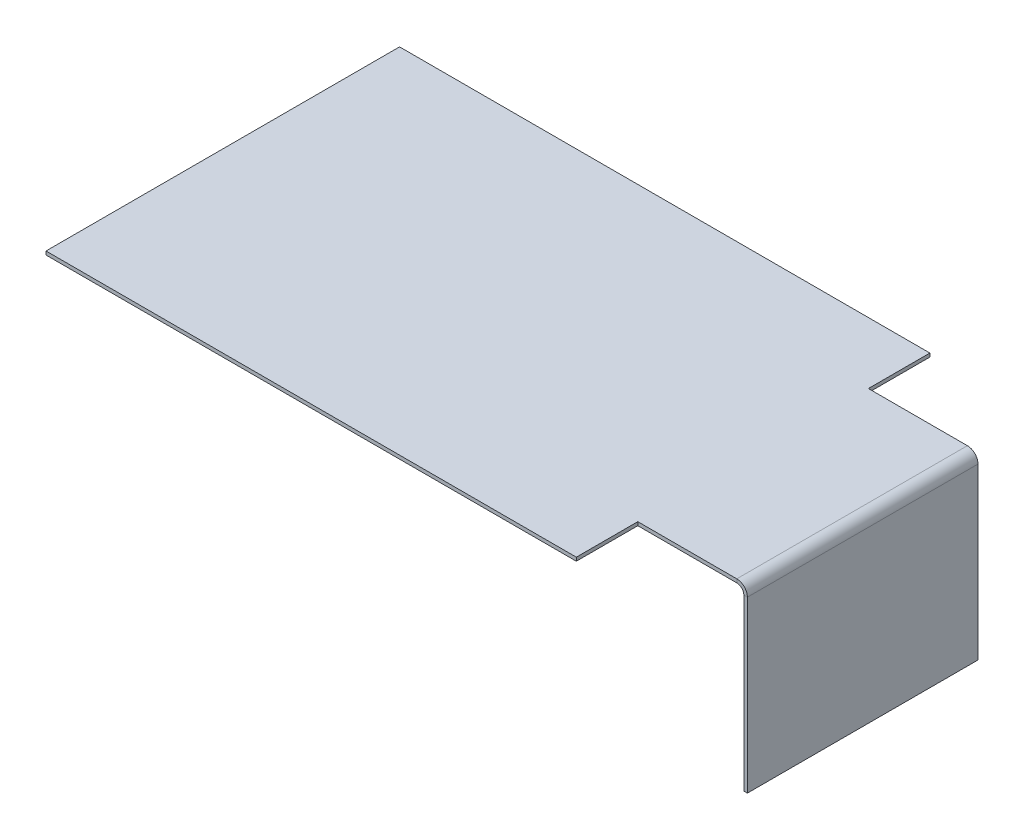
ISO-10303-21;
HEADER;
FILE_DESCRIPTION(('STEP AP214'),'2;1');
FILE_NAME('part.step','',(''),(''),'','','');
FILE_SCHEMA(('AUTOMOTIVE_DESIGN { 1 0 10303 214 1 1 1 1 }'));
ENDSEC;
DATA;
#1=APPLICATION_CONTEXT('core data for automotive mechanical design processes');
#2=APPLICATION_PROTOCOL_DEFINITION('international standard','automotive_design',2000,#1);
#3=PRODUCT_CONTEXT('',#1,'mechanical');
#4=PRODUCT('Part','Part','',(#3));
#5=PRODUCT_RELATED_PRODUCT_CATEGORY('part','',(#4));
#6=PRODUCT_DEFINITION_FORMATION('','',#4);
#7=PRODUCT_DEFINITION_CONTEXT('part definition',#1,'design');
#8=PRODUCT_DEFINITION('design','',#6,#7);
#9=PRODUCT_DEFINITION_SHAPE('','',#8);
#10=(LENGTH_UNIT() NAMED_UNIT(*) SI_UNIT(.MILLI.,.METRE.));
#11=(NAMED_UNIT(*) PLANE_ANGLE_UNIT() SI_UNIT($,.RADIAN.));
#12=(NAMED_UNIT(*) SI_UNIT($,.STERADIAN.) SOLID_ANGLE_UNIT());
#13=UNCERTAINTY_MEASURE_WITH_UNIT(LENGTH_MEASURE(1.E-05),#10,'distance_accuracy_value','');
#14=(GEOMETRIC_REPRESENTATION_CONTEXT(3) GLOBAL_UNCERTAINTY_ASSIGNED_CONTEXT((#13)) GLOBAL_UNIT_ASSIGNED_CONTEXT((#10,
#11,#12)) REPRESENTATION_CONTEXT('',''));
#15=CARTESIAN_POINT('',(0.,0.,0.));
#16=DIRECTION('',(0.,0.,1.));
#17=DIRECTION('',(1.,0.,0.));
#18=AXIS2_PLACEMENT_3D('',#15,#16,#17);
#19=CARTESIAN_POINT('',(103.,-2.,-32.6144));
#20=DIRECTION('',(0.,0.,-1.));
#21=DIRECTION('',(-1.,0.,0.));
#22=AXIS2_PLACEMENT_3D('',#19,#20,#21);
#23=PLANE('',#22);
#24=DIRECTION('',(1.,0.,0.));
#25=VECTOR('',#24,1.);
#26=CARTESIAN_POINT('',(106.,-1.99999999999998,-32.6144));
#27=LINE('',#26,#25);
#28=CARTESIAN_POINT('',(105.,-1.99999999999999,-32.6144));
#29=VERTEX_POINT('',#28);
#30=CARTESIAN_POINT('',(106.,-1.99999999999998,-32.6144));
#31=VERTEX_POINT('',#30);
#32=EDGE_CURVE('E161',#29,#31,#27,.T.);
#33=ORIENTED_EDGE('',*,*,#32,.F.);
#34=CARTESIAN_POINT('',(103.,-2.,-32.6144));
#35=DIRECTION('',(0.,0.,1.));
#36=DIRECTION('',(1.,0.,0.));
#37=AXIS2_PLACEMENT_3D('',#34,#35,#36);
#38=CIRCLE('',#37,2.);
#39=CARTESIAN_POINT('',(103.,0.,-32.6144));
#40=VERTEX_POINT('',#39);
#41=EDGE_CURVE('E124',#40,#29,#38,.F.);
#42=ORIENTED_EDGE('',*,*,#41,.F.);
#43=DIRECTION('',(0.,1.,0.));
#44=VECTOR('',#43,1.);
#45=CARTESIAN_POINT('',(103.,0.,-32.6144));
#46=LINE('',#45,#44);
#47=CARTESIAN_POINT('',(103.,1.00000000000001,-32.6144));
#48=VERTEX_POINT('',#47);
#49=EDGE_CURVE('E11',#40,#48,#46,.T.);
#50=ORIENTED_EDGE('',*,*,#49,.T.);
#51=CARTESIAN_POINT('',(103.,-2.,-32.6144));
#52=DIRECTION('',(0.,0.,1.));
#53=DIRECTION('',(1.,0.,0.));
#54=AXIS2_PLACEMENT_3D('',#51,#52,#53);
#55=CIRCLE('',#54,3.);
#56=EDGE_CURVE('E189',#48,#31,#55,.F.);
#57=ORIENTED_EDGE('',*,*,#56,.T.);
#58=EDGE_LOOP('',(#33,#42,#50,#57));
#59=FACE_BOUND('',#58,.T.);
#60=ADVANCED_FACE('F34',(#59),#23,.T.);
#61=CARTESIAN_POINT('',(103.,-2.,32.6144));
#62=DIRECTION('',(0.,0.,-1.));
#63=DIRECTION('',(-1.,0.,0.));
#64=AXIS2_PLACEMENT_3D('',#61,#62,#63);
#65=PLANE('',#64);
#66=CARTESIAN_POINT('',(103.,-2.,32.6144));
#67=DIRECTION('',(0.,0.,1.));
#68=DIRECTION('',(1.,0.,0.));
#69=AXIS2_PLACEMENT_3D('',#66,#67,#68);
#70=CIRCLE('',#69,2.);
#71=CARTESIAN_POINT('',(105.,-1.99999999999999,32.6144));
#72=VERTEX_POINT('',#71);
#73=CARTESIAN_POINT('',(103.,0.,32.6144));
#74=VERTEX_POINT('',#73);
#75=EDGE_CURVE('E130',#72,#74,#70,.T.);
#76=ORIENTED_EDGE('',*,*,#75,.F.);
#77=DIRECTION('',(1.,0.,0.));
#78=VECTOR('',#77,1.);
#79=CARTESIAN_POINT('',(105.,-1.99999999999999,32.6144));
#80=LINE('',#79,#78);
#81=CARTESIAN_POINT('',(106.,-1.99999999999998,32.6144));
#82=VERTEX_POINT('',#81);
#83=EDGE_CURVE('E128',#72,#82,#80,.T.);
#84=ORIENTED_EDGE('',*,*,#83,.T.);
#85=CARTESIAN_POINT('',(103.,-2.,32.6144));
#86=DIRECTION('',(0.,0.,1.));
#87=DIRECTION('',(1.,0.,0.));
#88=AXIS2_PLACEMENT_3D('',#85,#86,#87);
#89=CIRCLE('',#88,3.);
#90=CARTESIAN_POINT('',(103.,1.00000000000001,32.6144));
#91=VERTEX_POINT('',#90);
#92=EDGE_CURVE('E119',#82,#91,#89,.T.);
#93=ORIENTED_EDGE('',*,*,#92,.T.);
#94=DIRECTION('',(0.,1.,0.));
#95=VECTOR('',#94,1.);
#96=CARTESIAN_POINT('',(103.,0.,32.6144));
#97=LINE('',#96,#95);
#98=EDGE_CURVE('E38',#74,#91,#97,.T.);
#99=ORIENTED_EDGE('',*,*,#98,.F.);
#100=EDGE_LOOP('',(#76,#84,#93,#99));
#101=FACE_BOUND('',#100,.T.);
#102=ADVANCED_FACE('F36',(#101),#65,.F.);
#103=CARTESIAN_POINT('',(103.,-2.,32.6144));
#104=DIRECTION('',(0.,0.,1.));
#105=DIRECTION('',(1.,0.,0.));
#106=AXIS2_PLACEMENT_3D('',#103,#104,#105);
#107=CYLINDRICAL_SURFACE('',#106,3.);
#108=DIRECTION('',(0.,0.,1.));
#109=VECTOR('',#108,1.);
#110=CARTESIAN_POINT('',(103.,1.00000000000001,32.6144));
#111=LINE('',#110,#109);
#112=EDGE_CURVE('E49',#91,#48,#111,.F.);
#113=ORIENTED_EDGE('',*,*,#112,.F.);
#114=ORIENTED_EDGE('',*,*,#92,.F.);
#115=DIRECTION('',(0.,0.,1.));
#116=VECTOR('',#115,1.);
#117=CARTESIAN_POINT('',(106.,-1.99999999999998,32.6144));
#118=LINE('',#117,#116);
#119=EDGE_CURVE('E54',#31,#82,#118,.T.);
#120=ORIENTED_EDGE('',*,*,#119,.F.);
#121=ORIENTED_EDGE('',*,*,#56,.F.);
#122=EDGE_LOOP('',(#113,#114,#120,#121));
#123=FACE_BOUND('',#122,.T.);
#124=ADVANCED_FACE('F121',(#123),#107,.T.);
#125=CARTESIAN_POINT('',(103.,-2.,32.6144));
#126=DIRECTION('',(0.,0.,1.));
#127=DIRECTION('',(1.,0.,0.));
#128=AXIS2_PLACEMENT_3D('',#125,#126,#127);
#129=CYLINDRICAL_SURFACE('',#128,2.);
#130=DIRECTION('',(0.,0.,1.));
#131=VECTOR('',#130,1.);
#132=CARTESIAN_POINT('',(103.,0.,32.6144));
#133=LINE('',#132,#131);
#134=EDGE_CURVE('E184',#74,#40,#133,.F.);
#135=ORIENTED_EDGE('',*,*,#134,.T.);
#136=ORIENTED_EDGE('',*,*,#41,.T.);
#137=DIRECTION('',(0.,0.,-1.));
#138=VECTOR('',#137,1.);
#139=CARTESIAN_POINT('',(105.,-1.99999999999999,-32.6144));
#140=LINE('',#139,#138);
#141=EDGE_CURVE('E135',#29,#72,#140,.F.);
#142=ORIENTED_EDGE('',*,*,#141,.T.);
#143=ORIENTED_EDGE('',*,*,#75,.T.);
#144=EDGE_LOOP('',(#135,#136,#142,#143));
#145=FACE_BOUND('',#144,.T.);
#146=ADVANCED_FACE('F200',(#145),#129,.F.);
#147=CARTESIAN_POINT('',(75.,1.,-50.));
#148=DIRECTION('',(-1.,0.,0.));
#149=DIRECTION('',(0.,0.,1.));
#150=AXIS2_PLACEMENT_3D('',#147,#148,#149);
#151=PLANE('',#150);
#152=DIRECTION('',(0.,1.,0.));
#153=VECTOR('',#152,1.);
#154=CARTESIAN_POINT('',(75.,0.,-32.6144));
#155=LINE('',#154,#153);
#156=CARTESIAN_POINT('',(75.,0.,-32.6144));
#157=VERTEX_POINT('',#156);
#158=CARTESIAN_POINT('',(75.,1.00000000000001,-32.6144));
#159=VERTEX_POINT('',#158);
#160=EDGE_CURVE('E169',#157,#159,#155,.T.);
#161=ORIENTED_EDGE('',*,*,#160,.F.);
#162=DIRECTION('',(0.,0.,-1.));
#163=VECTOR('',#162,1.);
#164=CARTESIAN_POINT('',(75.,0.,-50.));
#165=LINE('',#164,#163);
#166=CARTESIAN_POINT('',(75.,0.,-50.));
#167=VERTEX_POINT('',#166);
#168=EDGE_CURVE('E413',#157,#167,#165,.T.);
#169=ORIENTED_EDGE('',*,*,#168,.T.);
#170=DIRECTION('',(0.,-1.,0.));
#171=VECTOR('',#170,1.);
#172=CARTESIAN_POINT('',(75.,1.,-50.));
#173=LINE('',#172,#171);
#174=CARTESIAN_POINT('',(75.,1.,-50.));
#175=VERTEX_POINT('',#174);
#176=EDGE_CURVE('E463',#175,#167,#173,.T.);
#177=ORIENTED_EDGE('',*,*,#176,.F.);
#178=DIRECTION('',(0.,0.,-1.));
#179=VECTOR('',#178,1.);
#180=CARTESIAN_POINT('',(75.,1.,-50.));
#181=LINE('',#180,#179);
#182=EDGE_CURVE('E415',#159,#175,#181,.T.);
#183=ORIENTED_EDGE('',*,*,#182,.F.);
#184=EDGE_LOOP('',(#161,#169,#177,#183));
#185=FACE_BOUND('',#184,.T.);
#186=ADVANCED_FACE('F233',(#185),#151,.F.);
#187=CARTESIAN_POINT('',(-75.,1.,-50.));
#188=DIRECTION('',(1.,0.,0.));
#189=DIRECTION('',(0.,0.,-1.));
#190=AXIS2_PLACEMENT_3D('',#187,#188,#189);
#191=PLANE('',#190);
#192=DIRECTION('',(0.,0.,1.));
#193=VECTOR('',#192,1.);
#194=CARTESIAN_POINT('',(-75.,0.,-50.));
#195=LINE('',#194,#193);
#196=CARTESIAN_POINT('',(-75.,0.,-50.));
#197=VERTEX_POINT('',#196);
#198=CARTESIAN_POINT('',(-75.,0.,50.));
#199=VERTEX_POINT('',#198);
#200=EDGE_CURVE('E427',#197,#199,#195,.T.);
#201=ORIENTED_EDGE('',*,*,#200,.T.);
#202=DIRECTION('',(0.,-1.,0.));
#203=VECTOR('',#202,1.);
#204=CARTESIAN_POINT('',(-75.,1.,50.));
#205=LINE('',#204,#203);
#206=CARTESIAN_POINT('',(-75.,1.,50.));
#207=VERTEX_POINT('',#206);
#208=EDGE_CURVE('E187',#207,#199,#205,.T.);
#209=ORIENTED_EDGE('',*,*,#208,.F.);
#210=DIRECTION('',(0.,0.,1.));
#211=VECTOR('',#210,1.);
#212=CARTESIAN_POINT('',(-75.,1.,-50.));
#213=LINE('',#212,#211);
#214=CARTESIAN_POINT('',(-75.,1.,-50.));
#215=VERTEX_POINT('',#214);
#216=EDGE_CURVE('E439',#215,#207,#213,.T.);
#217=ORIENTED_EDGE('',*,*,#216,.F.);
#218=DIRECTION('',(0.,-1.,0.));
#219=VECTOR('',#218,1.);
#220=CARTESIAN_POINT('',(-75.,1.,-50.));
#221=LINE('',#220,#219);
#222=EDGE_CURVE('E459',#215,#197,#221,.T.);
#223=ORIENTED_EDGE('',*,*,#222,.T.);
#224=EDGE_LOOP('',(#201,#209,#217,#223));
#225=FACE_BOUND('',#224,.T.);
#226=ADVANCED_FACE('F236',(#225),#191,.F.);
#227=CARTESIAN_POINT('',(-75.,1.,50.));
#228=DIRECTION('',(0.,0.,-1.));
#229=DIRECTION('',(-1.,0.,0.));
#230=AXIS2_PLACEMENT_3D('',#227,#228,#229);
#231=PLANE('',#230);
#232=DIRECTION('',(1.,0.,0.));
#233=VECTOR('',#232,1.);
#234=CARTESIAN_POINT('',(-75.,0.,50.));
#235=LINE('',#234,#233);
#236=CARTESIAN_POINT('',(75.,0.,50.));
#237=VERTEX_POINT('',#236);
#238=EDGE_CURVE('E423',#199,#237,#235,.T.);
#239=ORIENTED_EDGE('',*,*,#238,.T.);
#240=DIRECTION('',(0.,-1.,0.));
#241=VECTOR('',#240,1.);
#242=CARTESIAN_POINT('',(75.,1.,50.));
#243=LINE('',#242,#241);
#244=CARTESIAN_POINT('',(75.,1.,50.));
#245=VERTEX_POINT('',#244);
#246=EDGE_CURVE('E466',#245,#237,#243,.T.);
#247=ORIENTED_EDGE('',*,*,#246,.F.);
#248=DIRECTION('',(1.,0.,0.));
#249=VECTOR('',#248,1.);
#250=CARTESIAN_POINT('',(-75.,1.,50.));
#251=LINE('',#250,#249);
#252=EDGE_CURVE('E442',#207,#245,#251,.T.);
#253=ORIENTED_EDGE('',*,*,#252,.F.);
#254=ORIENTED_EDGE('',*,*,#208,.T.);
#255=EDGE_LOOP('',(#239,#247,#253,#254));
#256=FACE_BOUND('',#255,.T.);
#257=ADVANCED_FACE('F239',(#256),#231,.F.);
#258=CARTESIAN_POINT('',(75.,0.,32.6144));
#259=VERTEX_POINT('',#258);
#260=EDGE_CURVE('E422',#237,#259,#165,.T.);
#261=ORIENTED_EDGE('',*,*,#260,.T.);
#262=DIRECTION('',(0.,1.,0.));
#263=VECTOR('',#262,1.);
#264=CARTESIAN_POINT('',(75.,0.,32.6144));
#265=LINE('',#264,#263);
#266=CARTESIAN_POINT('',(75.,1.,32.6144));
#267=VERTEX_POINT('',#266);
#268=EDGE_CURVE('E173',#259,#267,#265,.T.);
#269=ORIENTED_EDGE('',*,*,#268,.T.);
#270=EDGE_CURVE('E432',#245,#267,#181,.T.);
#271=ORIENTED_EDGE('',*,*,#270,.F.);
#272=ORIENTED_EDGE('',*,*,#246,.T.);
#273=EDGE_LOOP('',(#261,#269,#271,#272));
#274=FACE_BOUND('',#273,.T.);
#275=ADVANCED_FACE('F243',(#274),#151,.F.);
#276=CARTESIAN_POINT('',(-75.,1.,-50.));
#277=DIRECTION('',(0.,0.,1.));
#278=DIRECTION('',(1.,0.,0.));
#279=AXIS2_PLACEMENT_3D('',#276,#277,#278);
#280=PLANE('',#279);
#281=DIRECTION('',(-1.,0.,0.));
#282=VECTOR('',#281,1.);
#283=CARTESIAN_POINT('',(-75.,0.,-50.));
#284=LINE('',#283,#282);
#285=EDGE_CURVE('E421',#167,#197,#284,.T.);
#286=ORIENTED_EDGE('',*,*,#285,.T.);
#287=ORIENTED_EDGE('',*,*,#222,.F.);
#288=DIRECTION('',(-1.,0.,0.));
#289=VECTOR('',#288,1.);
#290=CARTESIAN_POINT('',(-75.,1.,-50.));
#291=LINE('',#290,#289);
#292=EDGE_CURVE('E445',#175,#215,#291,.T.);
#293=ORIENTED_EDGE('',*,*,#292,.F.);
#294=ORIENTED_EDGE('',*,*,#176,.T.);
#295=EDGE_LOOP('',(#286,#287,#293,#294));
#296=FACE_BOUND('',#295,.T.);
#297=ADVANCED_FACE('F247',(#296),#280,.F.);
#298=CARTESIAN_POINT('',(-75.,1.,50.));
#299=DIRECTION('',(0.,1.,0.));
#300=DIRECTION('',(0.,0.,1.));
#301=AXIS2_PLACEMENT_3D('',#298,#299,#300);
#302=PLANE('',#301);
#303=ORIENTED_EDGE('',*,*,#216,.T.);
#304=ORIENTED_EDGE('',*,*,#252,.T.);
#305=ORIENTED_EDGE('',*,*,#270,.T.);
#306=DIRECTION('',(-1.,0.,0.));
#307=VECTOR('',#306,1.);
#308=CARTESIAN_POINT('',(103.,1.00000000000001,32.6144));
#309=LINE('',#308,#307);
#310=EDGE_CURVE('E178',#91,#267,#309,.T.);
#311=ORIENTED_EDGE('',*,*,#310,.F.);
#312=ORIENTED_EDGE('',*,*,#112,.T.);
#313=DIRECTION('',(-1.,0.,0.));
#314=VECTOR('',#313,1.);
#315=CARTESIAN_POINT('',(103.,1.00000000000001,-32.6144));
#316=LINE('',#315,#314);
#317=EDGE_CURVE('E176',#48,#159,#316,.T.);
#318=ORIENTED_EDGE('',*,*,#317,.T.);
#319=ORIENTED_EDGE('',*,*,#182,.T.);
#320=ORIENTED_EDGE('',*,*,#292,.T.);
#321=EDGE_LOOP('',(#303,#304,#305,#311,#312,#318,#319,#320));
#322=FACE_BOUND('',#321,.T.);
#323=ADVANCED_FACE('F251',(#322),#302,.T.);
#324=CARTESIAN_POINT('',(-75.,0.,50.));
#325=DIRECTION('',(0.,1.,0.));
#326=DIRECTION('',(0.,0.,1.));
#327=AXIS2_PLACEMENT_3D('',#324,#325,#326);
#328=PLANE('',#327);
#329=ORIENTED_EDGE('',*,*,#200,.F.);
#330=ORIENTED_EDGE('',*,*,#285,.F.);
#331=ORIENTED_EDGE('',*,*,#168,.F.);
#332=DIRECTION('',(-1.,0.,0.));
#333=VECTOR('',#332,1.);
#334=CARTESIAN_POINT('',(103.,0.,-32.6144));
#335=LINE('',#334,#333);
#336=EDGE_CURVE('E179',#40,#157,#335,.T.);
#337=ORIENTED_EDGE('',*,*,#336,.F.);
#338=ORIENTED_EDGE('',*,*,#134,.F.);
#339=DIRECTION('',(-1.,0.,0.));
#340=VECTOR('',#339,1.);
#341=CARTESIAN_POINT('',(103.,0.,32.6144));
#342=LINE('',#341,#340);
#343=EDGE_CURVE('E197',#74,#259,#342,.T.);
#344=ORIENTED_EDGE('',*,*,#343,.T.);
#345=ORIENTED_EDGE('',*,*,#260,.F.);
#346=ORIENTED_EDGE('',*,*,#238,.F.);
#347=EDGE_LOOP('',(#329,#330,#331,#337,#338,#344,#345,#346));
#348=FACE_BOUND('',#347,.T.);
#349=ADVANCED_FACE('F255',(#348),#328,.F.);
#350=CARTESIAN_POINT('',(103.,0.,32.6144));
#351=DIRECTION('',(0.,0.,1.));
#352=DIRECTION('',(0.,1.,0.));
#353=AXIS2_PLACEMENT_3D('',#350,#351,#352);
#354=PLANE('',#353);
#355=ORIENTED_EDGE('',*,*,#343,.F.);
#356=ORIENTED_EDGE('',*,*,#98,.T.);
#357=ORIENTED_EDGE('',*,*,#310,.T.);
#358=ORIENTED_EDGE('',*,*,#268,.F.);
#359=EDGE_LOOP('',(#355,#356,#357,#358));
#360=FACE_BOUND('',#359,.T.);
#361=ADVANCED_FACE('F194',(#360),#354,.T.);
#362=CARTESIAN_POINT('',(103.,0.,-32.6144));
#363=DIRECTION('',(0.,0.,1.));
#364=DIRECTION('',(0.,1.,0.));
#365=AXIS2_PLACEMENT_3D('',#362,#363,#364);
#366=PLANE('',#365);
#367=ORIENTED_EDGE('',*,*,#317,.F.);
#368=ORIENTED_EDGE('',*,*,#49,.F.);
#369=ORIENTED_EDGE('',*,*,#336,.T.);
#370=ORIENTED_EDGE('',*,*,#160,.T.);
#371=EDGE_LOOP('',(#367,#368,#369,#370));
#372=FACE_BOUND('',#371,.T.);
#373=ADVANCED_FACE('F262',(#372),#366,.F.);
#374=CARTESIAN_POINT('',(106.,0.,32.6144));
#375=DIRECTION('',(0.,0.,1.));
#376=DIRECTION('',(0.,-1.,0.));
#377=AXIS2_PLACEMENT_3D('',#374,#375,#376);
#378=PLANE('',#377);
#379=DIRECTION('',(0.,1.,0.));
#380=VECTOR('',#379,1.);
#381=CARTESIAN_POINT('',(106.,0.,32.6144));
#382=LINE('',#381,#380);
#383=CARTESIAN_POINT('',(106.,-50.,32.6144));
#384=VERTEX_POINT('',#383);
#385=EDGE_CURVE('E142',#384,#82,#382,.T.);
#386=ORIENTED_EDGE('',*,*,#385,.T.);
#387=ORIENTED_EDGE('',*,*,#83,.F.);
#388=DIRECTION('',(0.,-1.,0.));
#389=VECTOR('',#388,1.);
#390=CARTESIAN_POINT('',(105.,-50.,32.6144));
#391=LINE('',#390,#389);
#392=CARTESIAN_POINT('',(105.,-50.,32.6144));
#393=VERTEX_POINT('',#392);
#394=EDGE_CURVE('E145',#393,#72,#391,.F.);
#395=ORIENTED_EDGE('',*,*,#394,.F.);
#396=DIRECTION('',(-1.,0.,0.));
#397=VECTOR('',#396,1.);
#398=CARTESIAN_POINT('',(106.,-50.,32.6144));
#399=LINE('',#398,#397);
#400=EDGE_CURVE('E148',#384,#393,#399,.T.);
#401=ORIENTED_EDGE('',*,*,#400,.F.);
#402=EDGE_LOOP('',(#386,#387,#395,#401));
#403=FACE_BOUND('',#402,.T.);
#404=ADVANCED_FACE('F147',(#403),#378,.T.);
#405=CARTESIAN_POINT('',(106.,0.,-32.6144));
#406=DIRECTION('',(0.,0.,-1.));
#407=DIRECTION('',(0.,1.,0.));
#408=AXIS2_PLACEMENT_3D('',#405,#406,#407);
#409=PLANE('',#408);
#410=DIRECTION('',(0.,1.,0.));
#411=VECTOR('',#410,1.);
#412=CARTESIAN_POINT('',(105.,-50.,-32.6144));
#413=LINE('',#412,#411);
#414=CARTESIAN_POINT('',(105.,-50.,-32.6144));
#415=VERTEX_POINT('',#414);
#416=EDGE_CURVE('E154',#29,#415,#413,.F.);
#417=ORIENTED_EDGE('',*,*,#416,.F.);
#418=ORIENTED_EDGE('',*,*,#32,.T.);
#419=DIRECTION('',(0.,-1.,0.));
#420=VECTOR('',#419,1.);
#421=CARTESIAN_POINT('',(106.,0.,-32.6144));
#422=LINE('',#421,#420);
#423=CARTESIAN_POINT('',(106.,-50.,-32.6144));
#424=VERTEX_POINT('',#423);
#425=EDGE_CURVE('E144',#31,#424,#422,.T.);
#426=ORIENTED_EDGE('',*,*,#425,.T.);
#427=DIRECTION('',(-1.,0.,0.));
#428=VECTOR('',#427,1.);
#429=CARTESIAN_POINT('',(106.,-50.,-32.6144));
#430=LINE('',#429,#428);
#431=EDGE_CURVE('E210',#424,#415,#430,.T.);
#432=ORIENTED_EDGE('',*,*,#431,.T.);
#433=EDGE_LOOP('',(#417,#418,#426,#432));
#434=FACE_BOUND('',#433,.T.);
#435=ADVANCED_FACE('F208',(#434),#409,.T.);
#436=CARTESIAN_POINT('',(106.,-50.,32.6144));
#437=DIRECTION('',(1.,0.,0.));
#438=DIRECTION('',(0.,1.,0.));
#439=AXIS2_PLACEMENT_3D('',#436,#437,#438);
#440=PLANE('',#439);
#441=ORIENTED_EDGE('',*,*,#425,.F.);
#442=ORIENTED_EDGE('',*,*,#119,.T.);
#443=ORIENTED_EDGE('',*,*,#385,.F.);
#444=DIRECTION('',(0.,0.,1.));
#445=VECTOR('',#444,1.);
#446=CARTESIAN_POINT('',(106.,-50.,32.6144));
#447=LINE('',#446,#445);
#448=EDGE_CURVE('E151',#424,#384,#447,.T.);
#449=ORIENTED_EDGE('',*,*,#448,.F.);
#450=EDGE_LOOP('',(#441,#442,#443,#449));
#451=FACE_BOUND('',#450,.T.);
#452=ADVANCED_FACE('F140',(#451),#440,.T.);
#453=CARTESIAN_POINT('',(105.,-50.,32.6144));
#454=DIRECTION('',(1.,0.,0.));
#455=DIRECTION('',(0.,1.,0.));
#456=AXIS2_PLACEMENT_3D('',#453,#454,#455);
#457=PLANE('',#456);
#458=ORIENTED_EDGE('',*,*,#141,.F.);
#459=ORIENTED_EDGE('',*,*,#416,.T.);
#460=DIRECTION('',(0.,0.,-1.));
#461=VECTOR('',#460,1.);
#462=CARTESIAN_POINT('',(105.,-50.,32.6144));
#463=LINE('',#462,#461);
#464=EDGE_CURVE('E149',#415,#393,#463,.F.);
#465=ORIENTED_EDGE('',*,*,#464,.T.);
#466=ORIENTED_EDGE('',*,*,#394,.T.);
#467=EDGE_LOOP('',(#458,#459,#465,#466));
#468=FACE_BOUND('',#467,.T.);
#469=ADVANCED_FACE('F205',(#468),#457,.F.);
#470=CARTESIAN_POINT('',(106.,-50.,32.6144));
#471=DIRECTION('',(0.,-1.,0.));
#472=DIRECTION('',(1.,0.,0.));
#473=AXIS2_PLACEMENT_3D('',#470,#471,#472);
#474=PLANE('',#473);
#475=ORIENTED_EDGE('',*,*,#464,.F.);
#476=ORIENTED_EDGE('',*,*,#431,.F.);
#477=ORIENTED_EDGE('',*,*,#448,.T.);
#478=ORIENTED_EDGE('',*,*,#400,.T.);
#479=EDGE_LOOP('',(#475,#476,#477,#478));
#480=FACE_BOUND('',#479,.T.);
#481=ADVANCED_FACE('F214',(#480),#474,.T.);
#482=CLOSED_SHELL('',(#60,#102,#124,#146,#186,#226,#257,#275,#297,#323,#349,#361,#373,#404,#435,
#452,#469,#481));
#483=MANIFOLD_SOLID_BREP('B2',#482);
#484=ADVANCED_BREP_SHAPE_REPRESENTATION('',(#18,#483),#14);
#485=SHAPE_DEFINITION_REPRESENTATION(#9,#484);
ENDSEC;
END-ISO-10303-21;
